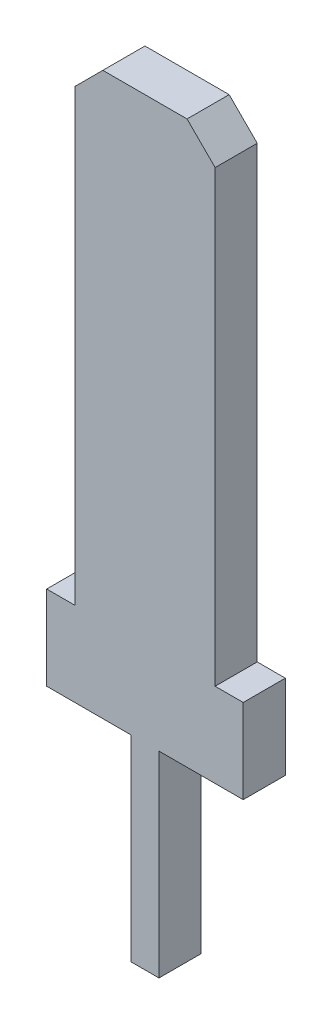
ISO-10303-21;
HEADER;
FILE_DESCRIPTION(('STEP AP214'),'2;1');
FILE_NAME('part.step','',(''),(''),'','','');
FILE_SCHEMA(('AUTOMOTIVE_DESIGN { 1 0 10303 214 1 1 1 1 }'));
ENDSEC;
DATA;
#1=APPLICATION_CONTEXT('core data for automotive mechanical design processes');
#2=APPLICATION_PROTOCOL_DEFINITION('international standard','automotive_design',2000,#1);
#3=PRODUCT_CONTEXT('',#1,'mechanical');
#4=PRODUCT('Part','Part','',(#3));
#5=PRODUCT_RELATED_PRODUCT_CATEGORY('part','',(#4));
#6=PRODUCT_DEFINITION_FORMATION('','',#4);
#7=PRODUCT_DEFINITION_CONTEXT('part definition',#1,'design');
#8=PRODUCT_DEFINITION('design','',#6,#7);
#9=PRODUCT_DEFINITION_SHAPE('','',#8);
#10=(LENGTH_UNIT() NAMED_UNIT(*) SI_UNIT(.MILLI.,.METRE.));
#11=(NAMED_UNIT(*) PLANE_ANGLE_UNIT() SI_UNIT($,.RADIAN.));
#12=(NAMED_UNIT(*) SI_UNIT($,.STERADIAN.) SOLID_ANGLE_UNIT());
#13=UNCERTAINTY_MEASURE_WITH_UNIT(LENGTH_MEASURE(1.E-05),#10,'distance_accuracy_value','');
#14=(GEOMETRIC_REPRESENTATION_CONTEXT(3) GLOBAL_UNCERTAINTY_ASSIGNED_CONTEXT((#13)) GLOBAL_UNIT_ASSIGNED_CONTEXT((#10,
#11,#12)) REPRESENTATION_CONTEXT('',''));
#15=CARTESIAN_POINT('',(0.,0.,0.));
#16=DIRECTION('',(0.,0.,1.));
#17=DIRECTION('',(1.,0.,0.));
#18=AXIS2_PLACEMENT_3D('',#15,#16,#17);
#19=CARTESIAN_POINT('',(1.74999999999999,1.5,0.375));
#20=DIRECTION('',(0.,-1.,0.));
#21=DIRECTION('',(1.,0.,0.));
#22=AXIS2_PLACEMENT_3D('',#19,#20,#21);
#23=PLANE('',#22);
#24=DIRECTION('',(-1.,0.,0.));
#25=VECTOR('',#24,1.);
#26=CARTESIAN_POINT('',(1.74999999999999,1.5,-0.375));
#27=LINE('',#26,#25);
#28=CARTESIAN_POINT('',(1.74999999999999,1.5,-0.375));
#29=VERTEX_POINT('',#28);
#30=CARTESIAN_POINT('',(1.25,1.5,-0.375));
#31=VERTEX_POINT('',#30);
#32=EDGE_CURVE('E137',#29,#31,#27,.T.);
#33=ORIENTED_EDGE('',*,*,#32,.T.);
#34=DIRECTION('',(0.,0.,-1.));
#35=VECTOR('',#34,1.);
#36=CARTESIAN_POINT('',(1.25,1.5,0.375));
#37=LINE('',#36,#35);
#38=CARTESIAN_POINT('',(1.25,1.5,0.375));
#39=VERTEX_POINT('',#38);
#40=EDGE_CURVE('E144',#39,#31,#37,.T.);
#41=ORIENTED_EDGE('',*,*,#40,.F.);
#42=DIRECTION('',(-1.,0.,0.));
#43=VECTOR('',#42,1.);
#44=CARTESIAN_POINT('',(1.74999999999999,1.5,0.375));
#45=LINE('',#44,#43);
#46=CARTESIAN_POINT('',(1.74999999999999,1.5,0.375));
#47=VERTEX_POINT('',#46);
#48=EDGE_CURVE('E178',#47,#39,#45,.T.);
#49=ORIENTED_EDGE('',*,*,#48,.F.);
#50=DIRECTION('',(0.,0.,-1.));
#51=VECTOR('',#50,1.);
#52=CARTESIAN_POINT('',(1.74999999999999,1.5,0.375));
#53=LINE('',#52,#51);
#54=EDGE_CURVE('E156',#47,#29,#53,.T.);
#55=ORIENTED_EDGE('',*,*,#54,.T.);
#56=EDGE_LOOP('',(#33,#41,#49,#55));
#57=FACE_BOUND('',#56,.T.);
#58=ADVANCED_FACE('F33',(#57),#23,.F.);
#59=CARTESIAN_POINT('',(1.25,10.,0.375));
#60=DIRECTION('',(-1.,0.,0.));
#61=DIRECTION('',(0.,-1.,0.));
#62=AXIS2_PLACEMENT_3D('',#59,#60,#61);
#63=PLANE('',#62);
#64=DIRECTION('',(0.,1.,0.));
#65=VECTOR('',#64,1.);
#66=CARTESIAN_POINT('',(1.25,10.,-0.375));
#67=LINE('',#66,#65);
#68=CARTESIAN_POINT('',(1.25,9.5,-0.375));
#69=VERTEX_POINT('',#68);
#70=EDGE_CURVE('E132',#31,#69,#67,.T.);
#71=ORIENTED_EDGE('',*,*,#70,.T.);
#72=DIRECTION('',(0.,0.,1.));
#73=VECTOR('',#72,1.);
#74=CARTESIAN_POINT('',(1.25,9.5,0.375));
#75=LINE('',#74,#73);
#76=CARTESIAN_POINT('',(1.25,9.5,0.375));
#77=VERTEX_POINT('',#76);
#78=EDGE_CURVE('E228',#69,#77,#75,.T.);
#79=ORIENTED_EDGE('',*,*,#78,.T.);
#80=DIRECTION('',(0.,1.,0.));
#81=VECTOR('',#80,1.);
#82=CARTESIAN_POINT('',(1.25,10.,0.375));
#83=LINE('',#82,#81);
#84=EDGE_CURVE('E147',#39,#77,#83,.T.);
#85=ORIENTED_EDGE('',*,*,#84,.F.);
#86=ORIENTED_EDGE('',*,*,#40,.T.);
#87=EDGE_LOOP('',(#71,#79,#85,#86));
#88=FACE_BOUND('',#87,.T.);
#89=ADVANCED_FACE('F145',(#88),#63,.F.);
#90=CARTESIAN_POINT('',(1.25,10.,0.375));
#91=DIRECTION('',(0.,-1.,0.));
#92=DIRECTION('',(0.,0.,-1.));
#93=AXIS2_PLACEMENT_3D('',#90,#91,#92);
#94=PLANE('',#93);
#95=DIRECTION('',(-1.,0.,0.));
#96=VECTOR('',#95,1.);
#97=CARTESIAN_POINT('',(1.25,10.,-0.375));
#98=LINE('',#97,#96);
#99=CARTESIAN_POINT('',(0.749999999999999,10.,-0.375));
#100=VERTEX_POINT('',#99);
#101=CARTESIAN_POINT('',(-0.749999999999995,10.,-0.375));
#102=VERTEX_POINT('',#101);
#103=EDGE_CURVE('E141',#100,#102,#98,.T.);
#104=ORIENTED_EDGE('',*,*,#103,.T.);
#105=DIRECTION('',(0.,0.,1.));
#106=VECTOR('',#105,1.);
#107=CARTESIAN_POINT('',(-0.749999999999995,10.,0.375));
#108=LINE('',#107,#106);
#109=CARTESIAN_POINT('',(-0.749999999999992,10.,0.375));
#110=VERTEX_POINT('',#109);
#111=EDGE_CURVE('E40',#102,#110,#108,.T.);
#112=ORIENTED_EDGE('',*,*,#111,.T.);
#113=DIRECTION('',(-1.,0.,0.));
#114=VECTOR('',#113,1.);
#115=CARTESIAN_POINT('',(1.25,10.,0.375));
#116=LINE('',#115,#114);
#117=CARTESIAN_POINT('',(0.749999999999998,10.,0.375));
#118=VERTEX_POINT('',#117);
#119=EDGE_CURVE('E181',#118,#110,#116,.T.);
#120=ORIENTED_EDGE('',*,*,#119,.F.);
#121=DIRECTION('',(0.,0.,-1.));
#122=VECTOR('',#121,1.);
#123=CARTESIAN_POINT('',(0.749999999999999,10.,0.375));
#124=LINE('',#123,#122);
#125=EDGE_CURVE('E151',#118,#100,#124,.T.);
#126=ORIENTED_EDGE('',*,*,#125,.T.);
#127=EDGE_LOOP('',(#104,#112,#120,#126));
#128=FACE_BOUND('',#127,.T.);
#129=ADVANCED_FACE('F270',(#128),#94,.F.);
#130=CARTESIAN_POINT('',(-1.25,10.,0.375));
#131=DIRECTION('',(1.,0.,0.));
#132=DIRECTION('',(0.,1.,0.));
#133=AXIS2_PLACEMENT_3D('',#130,#131,#132);
#134=PLANE('',#133);
#135=DIRECTION('',(0.,-1.,0.));
#136=VECTOR('',#135,1.);
#137=CARTESIAN_POINT('',(-1.25,10.,0.375));
#138=LINE('',#137,#136);
#139=CARTESIAN_POINT('',(-1.25,9.5,0.375));
#140=VERTEX_POINT('',#139);
#141=CARTESIAN_POINT('',(-1.25,1.5,0.375));
#142=VERTEX_POINT('',#141);
#143=EDGE_CURVE('E183',#140,#142,#138,.T.);
#144=ORIENTED_EDGE('',*,*,#143,.F.);
#145=DIRECTION('',(0.,0.,-1.));
#146=VECTOR('',#145,1.);
#147=CARTESIAN_POINT('',(-1.25,9.5,0.375));
#148=LINE('',#147,#146);
#149=CARTESIAN_POINT('',(-1.25,9.5,-0.375));
#150=VERTEX_POINT('',#149);
#151=EDGE_CURVE('E232',#140,#150,#148,.T.);
#152=ORIENTED_EDGE('',*,*,#151,.T.);
#153=DIRECTION('',(0.,-1.,0.));
#154=VECTOR('',#153,1.);
#155=CARTESIAN_POINT('',(-1.25,10.,-0.375));
#156=LINE('',#155,#154);
#157=CARTESIAN_POINT('',(-1.25,1.5,-0.375));
#158=VERTEX_POINT('',#157);
#159=EDGE_CURVE('E160',#150,#158,#156,.T.);
#160=ORIENTED_EDGE('',*,*,#159,.T.);
#161=DIRECTION('',(0.,0.,-1.));
#162=VECTOR('',#161,1.);
#163=CARTESIAN_POINT('',(-1.25,1.5,0.375));
#164=LINE('',#163,#162);
#165=EDGE_CURVE('E152',#142,#158,#164,.T.);
#166=ORIENTED_EDGE('',*,*,#165,.F.);
#167=EDGE_LOOP('',(#144,#152,#160,#166));
#168=FACE_BOUND('',#167,.T.);
#169=ADVANCED_FACE('F238',(#168),#134,.F.);
#170=CARTESIAN_POINT('',(-1.74999999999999,1.5,0.375));
#171=DIRECTION('',(0.,-1.,0.));
#172=DIRECTION('',(1.,0.,0.));
#173=AXIS2_PLACEMENT_3D('',#170,#171,#172);
#174=PLANE('',#173);
#175=DIRECTION('',(-1.,0.,0.));
#176=VECTOR('',#175,1.);
#177=CARTESIAN_POINT('',(-1.74999999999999,1.5,-0.375));
#178=LINE('',#177,#176);
#179=CARTESIAN_POINT('',(-1.74999999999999,1.5,-0.375));
#180=VERTEX_POINT('',#179);
#181=EDGE_CURVE('E162',#158,#180,#178,.T.);
#182=ORIENTED_EDGE('',*,*,#181,.T.);
#183=DIRECTION('',(0.,0.,-1.));
#184=VECTOR('',#183,1.);
#185=CARTESIAN_POINT('',(-1.74999999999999,1.5,0.375));
#186=LINE('',#185,#184);
#187=CARTESIAN_POINT('',(-1.74999999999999,1.5,0.375));
#188=VERTEX_POINT('',#187);
#189=EDGE_CURVE('E220',#188,#180,#186,.T.);
#190=ORIENTED_EDGE('',*,*,#189,.F.);
#191=DIRECTION('',(-1.,0.,0.));
#192=VECTOR('',#191,1.);
#193=CARTESIAN_POINT('',(-1.74999999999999,1.5,0.375));
#194=LINE('',#193,#192);
#195=EDGE_CURVE('E185',#142,#188,#194,.T.);
#196=ORIENTED_EDGE('',*,*,#195,.F.);
#197=ORIENTED_EDGE('',*,*,#165,.T.);
#198=EDGE_LOOP('',(#182,#190,#196,#197));
#199=FACE_BOUND('',#198,.T.);
#200=ADVANCED_FACE('F247',(#199),#174,.F.);
#201=CARTESIAN_POINT('',(-1.74999999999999,1.5,0.375));
#202=DIRECTION('',(1.,0.,0.));
#203=DIRECTION('',(0.,0.,-1.));
#204=AXIS2_PLACEMENT_3D('',#201,#202,#203);
#205=PLANE('',#204);
#206=DIRECTION('',(0.,-1.,0.));
#207=VECTOR('',#206,1.);
#208=CARTESIAN_POINT('',(-1.74999999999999,1.5,-0.375));
#209=LINE('',#208,#207);
#210=CARTESIAN_POINT('',(-1.74999999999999,0.,-0.375));
#211=VERTEX_POINT('',#210);
#212=EDGE_CURVE('E164',#180,#211,#209,.T.);
#213=ORIENTED_EDGE('',*,*,#212,.T.);
#214=DIRECTION('',(0.,0.,-1.));
#215=VECTOR('',#214,1.);
#216=CARTESIAN_POINT('',(-1.74999999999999,0.,0.375));
#217=LINE('',#216,#215);
#218=CARTESIAN_POINT('',(-1.74999999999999,0.,0.375));
#219=VERTEX_POINT('',#218);
#220=EDGE_CURVE('E217',#219,#211,#217,.T.);
#221=ORIENTED_EDGE('',*,*,#220,.F.);
#222=DIRECTION('',(0.,-1.,0.));
#223=VECTOR('',#222,1.);
#224=CARTESIAN_POINT('',(-1.74999999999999,1.5,0.375));
#225=LINE('',#224,#223);
#226=EDGE_CURVE('E187',#188,#219,#225,.T.);
#227=ORIENTED_EDGE('',*,*,#226,.F.);
#228=ORIENTED_EDGE('',*,*,#189,.T.);
#229=EDGE_LOOP('',(#213,#221,#227,#228));
#230=FACE_BOUND('',#229,.T.);
#231=ADVANCED_FACE('F251',(#230),#205,.F.);
#232=CARTESIAN_POINT('',(-1.74999999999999,0.,0.375));
#233=DIRECTION('',(0.,1.,0.));
#234=DIRECTION('',(0.,0.,1.));
#235=AXIS2_PLACEMENT_3D('',#232,#233,#234);
#236=PLANE('',#235);
#237=DIRECTION('',(1.,0.,0.));
#238=VECTOR('',#237,1.);
#239=CARTESIAN_POINT('',(-1.74999999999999,0.,-0.375));
#240=LINE('',#239,#238);
#241=CARTESIAN_POINT('',(-0.249999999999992,0.,-0.375));
#242=VERTEX_POINT('',#241);
#243=EDGE_CURVE('E166',#211,#242,#240,.T.);
#244=ORIENTED_EDGE('',*,*,#243,.T.);
#245=DIRECTION('',(0.,0.,-1.));
#246=VECTOR('',#245,1.);
#247=CARTESIAN_POINT('',(-0.249999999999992,0.,0.375));
#248=LINE('',#247,#246);
#249=CARTESIAN_POINT('',(-0.249999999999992,0.,0.375));
#250=VERTEX_POINT('',#249);
#251=EDGE_CURVE('E214',#250,#242,#248,.T.);
#252=ORIENTED_EDGE('',*,*,#251,.F.);
#253=DIRECTION('',(1.,0.,0.));
#254=VECTOR('',#253,1.);
#255=CARTESIAN_POINT('',(-1.74999999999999,0.,0.375));
#256=LINE('',#255,#254);
#257=EDGE_CURVE('E189',#219,#250,#256,.T.);
#258=ORIENTED_EDGE('',*,*,#257,.F.);
#259=ORIENTED_EDGE('',*,*,#220,.T.);
#260=EDGE_LOOP('',(#244,#252,#258,#259));
#261=FACE_BOUND('',#260,.T.);
#262=ADVANCED_FACE('F282',(#261),#236,.F.);
#263=CARTESIAN_POINT('',(-0.249999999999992,0.,0.375));
#264=DIRECTION('',(1.,0.,0.));
#265=DIRECTION('',(0.,1.,0.));
#266=AXIS2_PLACEMENT_3D('',#263,#264,#265);
#267=PLANE('',#266);
#268=DIRECTION('',(0.,-1.,0.));
#269=VECTOR('',#268,1.);
#270=CARTESIAN_POINT('',(-0.249999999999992,0.,-0.375));
#271=LINE('',#270,#269);
#272=CARTESIAN_POINT('',(-0.249999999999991,-3.5,-0.375));
#273=VERTEX_POINT('',#272);
#274=EDGE_CURVE('E168',#242,#273,#271,.T.);
#275=ORIENTED_EDGE('',*,*,#274,.T.);
#276=DIRECTION('',(0.,0.,-1.));
#277=VECTOR('',#276,1.);
#278=CARTESIAN_POINT('',(-0.249999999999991,-3.5,0.375));
#279=LINE('',#278,#277);
#280=CARTESIAN_POINT('',(-0.249999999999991,-3.5,0.375));
#281=VERTEX_POINT('',#280);
#282=EDGE_CURVE('E211',#281,#273,#279,.T.);
#283=ORIENTED_EDGE('',*,*,#282,.F.);
#284=DIRECTION('',(0.,-1.,0.));
#285=VECTOR('',#284,1.);
#286=CARTESIAN_POINT('',(-0.249999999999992,0.,0.375));
#287=LINE('',#286,#285);
#288=EDGE_CURVE('E191',#250,#281,#287,.T.);
#289=ORIENTED_EDGE('',*,*,#288,.F.);
#290=ORIENTED_EDGE('',*,*,#251,.T.);
#291=EDGE_LOOP('',(#275,#283,#289,#290));
#292=FACE_BOUND('',#291,.T.);
#293=ADVANCED_FACE('F285',(#292),#267,.F.);
#294=CARTESIAN_POINT('',(-0.249999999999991,-3.5,0.375));
#295=DIRECTION('',(0.,1.,0.));
#296=DIRECTION('',(0.,0.,1.));
#297=AXIS2_PLACEMENT_3D('',#294,#295,#296);
#298=PLANE('',#297);
#299=DIRECTION('',(1.,0.,0.));
#300=VECTOR('',#299,1.);
#301=CARTESIAN_POINT('',(-0.249999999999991,-3.5,-0.375));
#302=LINE('',#301,#300);
#303=CARTESIAN_POINT('',(0.249999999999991,-3.5,-0.375));
#304=VERTEX_POINT('',#303);
#305=EDGE_CURVE('E170',#273,#304,#302,.T.);
#306=ORIENTED_EDGE('',*,*,#305,.T.);
#307=DIRECTION('',(0.,0.,-1.));
#308=VECTOR('',#307,1.);
#309=CARTESIAN_POINT('',(0.249999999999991,-3.5,0.375));
#310=LINE('',#309,#308);
#311=CARTESIAN_POINT('',(0.249999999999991,-3.5,0.375));
#312=VERTEX_POINT('',#311);
#313=EDGE_CURVE('E208',#312,#304,#310,.T.);
#314=ORIENTED_EDGE('',*,*,#313,.F.);
#315=DIRECTION('',(1.,0.,0.));
#316=VECTOR('',#315,1.);
#317=CARTESIAN_POINT('',(-0.249999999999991,-3.5,0.375));
#318=LINE('',#317,#316);
#319=EDGE_CURVE('E193',#281,#312,#318,.T.);
#320=ORIENTED_EDGE('',*,*,#319,.F.);
#321=ORIENTED_EDGE('',*,*,#282,.T.);
#322=EDGE_LOOP('',(#306,#314,#320,#321));
#323=FACE_BOUND('',#322,.T.);
#324=ADVANCED_FACE('F289',(#323),#298,.F.);
#325=CARTESIAN_POINT('',(0.249999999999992,0.,0.375));
#326=DIRECTION('',(-1.,0.,0.));
#327=DIRECTION('',(0.,-1.,0.));
#328=AXIS2_PLACEMENT_3D('',#325,#326,#327);
#329=PLANE('',#328);
#330=DIRECTION('',(0.,1.,0.));
#331=VECTOR('',#330,1.);
#332=CARTESIAN_POINT('',(0.249999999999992,0.,-0.375));
#333=LINE('',#332,#331);
#334=CARTESIAN_POINT('',(0.249999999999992,0.,-0.375));
#335=VERTEX_POINT('',#334);
#336=EDGE_CURVE('E172',#304,#335,#333,.T.);
#337=ORIENTED_EDGE('',*,*,#336,.T.);
#338=DIRECTION('',(0.,0.,-1.));
#339=VECTOR('',#338,1.);
#340=CARTESIAN_POINT('',(0.249999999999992,0.,0.375));
#341=LINE('',#340,#339);
#342=CARTESIAN_POINT('',(0.249999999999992,0.,0.375));
#343=VERTEX_POINT('',#342);
#344=EDGE_CURVE('E205',#343,#335,#341,.T.);
#345=ORIENTED_EDGE('',*,*,#344,.F.);
#346=DIRECTION('',(0.,1.,0.));
#347=VECTOR('',#346,1.);
#348=CARTESIAN_POINT('',(0.249999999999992,0.,0.375));
#349=LINE('',#348,#347);
#350=EDGE_CURVE('E195',#312,#343,#349,.T.);
#351=ORIENTED_EDGE('',*,*,#350,.F.);
#352=ORIENTED_EDGE('',*,*,#313,.T.);
#353=EDGE_LOOP('',(#337,#345,#351,#352));
#354=FACE_BOUND('',#353,.T.);
#355=ADVANCED_FACE('F293',(#354),#329,.F.);
#356=CARTESIAN_POINT('',(1.74999999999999,0.,0.375));
#357=DIRECTION('',(0.,1.,0.));
#358=DIRECTION('',(0.,0.,1.));
#359=AXIS2_PLACEMENT_3D('',#356,#357,#358);
#360=PLANE('',#359);
#361=DIRECTION('',(1.,0.,0.));
#362=VECTOR('',#361,1.);
#363=CARTESIAN_POINT('',(1.74999999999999,0.,-0.375));
#364=LINE('',#363,#362);
#365=CARTESIAN_POINT('',(1.74999999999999,0.,-0.375));
#366=VERTEX_POINT('',#365);
#367=EDGE_CURVE('E174',#335,#366,#364,.T.);
#368=ORIENTED_EDGE('',*,*,#367,.T.);
#369=DIRECTION('',(0.,0.,-1.));
#370=VECTOR('',#369,1.);
#371=CARTESIAN_POINT('',(1.74999999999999,0.,0.375));
#372=LINE('',#371,#370);
#373=CARTESIAN_POINT('',(1.74999999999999,0.,0.375));
#374=VERTEX_POINT('',#373);
#375=EDGE_CURVE('E202',#374,#366,#372,.T.);
#376=ORIENTED_EDGE('',*,*,#375,.F.);
#377=DIRECTION('',(1.,0.,0.));
#378=VECTOR('',#377,1.);
#379=CARTESIAN_POINT('',(1.74999999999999,0.,0.375));
#380=LINE('',#379,#378);
#381=EDGE_CURVE('E197',#343,#374,#380,.T.);
#382=ORIENTED_EDGE('',*,*,#381,.F.);
#383=ORIENTED_EDGE('',*,*,#344,.T.);
#384=EDGE_LOOP('',(#368,#376,#382,#383));
#385=FACE_BOUND('',#384,.T.);
#386=ADVANCED_FACE('F297',(#385),#360,.F.);
#387=CARTESIAN_POINT('',(1.74999999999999,1.5,0.375));
#388=DIRECTION('',(-1.,0.,0.));
#389=DIRECTION('',(0.,0.,1.));
#390=AXIS2_PLACEMENT_3D('',#387,#388,#389);
#391=PLANE('',#390);
#392=DIRECTION('',(0.,1.,0.));
#393=VECTOR('',#392,1.);
#394=CARTESIAN_POINT('',(1.74999999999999,1.5,-0.375));
#395=LINE('',#394,#393);
#396=EDGE_CURVE('E176',#366,#29,#395,.T.);
#397=ORIENTED_EDGE('',*,*,#396,.T.);
#398=ORIENTED_EDGE('',*,*,#54,.F.);
#399=DIRECTION('',(0.,1.,0.));
#400=VECTOR('',#399,1.);
#401=CARTESIAN_POINT('',(1.74999999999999,1.5,0.375));
#402=LINE('',#401,#400);
#403=EDGE_CURVE('E199',#374,#47,#402,.T.);
#404=ORIENTED_EDGE('',*,*,#403,.F.);
#405=ORIENTED_EDGE('',*,*,#375,.T.);
#406=EDGE_LOOP('',(#397,#398,#404,#405));
#407=FACE_BOUND('',#406,.T.);
#408=ADVANCED_FACE('F301',(#407),#391,.F.);
#409=CARTESIAN_POINT('',(0.249999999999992,1.5,0.375));
#410=DIRECTION('',(0.,0.,1.));
#411=DIRECTION('',(1.,0.,0.));
#412=AXIS2_PLACEMENT_3D('',#409,#410,#411);
#413=PLANE('',#412);
#414=ORIENTED_EDGE('',*,*,#119,.T.);
#415=DIRECTION('',(0.70710678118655,0.707106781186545,0.));
#416=VECTOR('',#415,1.);
#417=CARTESIAN_POINT('',(-4.5,6.25000000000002,0.375));
#418=LINE('',#417,#416);
#419=EDGE_CURVE('E11',#110,#140,#418,.F.);
#420=ORIENTED_EDGE('',*,*,#419,.T.);
#421=ORIENTED_EDGE('',*,*,#143,.T.);
#422=ORIENTED_EDGE('',*,*,#195,.T.);
#423=ORIENTED_EDGE('',*,*,#226,.T.);
#424=ORIENTED_EDGE('',*,*,#257,.T.);
#425=ORIENTED_EDGE('',*,*,#288,.T.);
#426=ORIENTED_EDGE('',*,*,#319,.T.);
#427=ORIENTED_EDGE('',*,*,#350,.T.);
#428=ORIENTED_EDGE('',*,*,#381,.T.);
#429=ORIENTED_EDGE('',*,*,#403,.T.);
#430=ORIENTED_EDGE('',*,*,#48,.T.);
#431=ORIENTED_EDGE('',*,*,#84,.T.);
#432=DIRECTION('',(0.707106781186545,-0.70710678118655,0.));
#433=VECTOR('',#432,1.);
#434=CARTESIAN_POINT('',(4.75,5.99999999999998,0.375));
#435=LINE('',#434,#433);
#436=EDGE_CURVE('E230',#77,#118,#435,.F.);
#437=ORIENTED_EDGE('',*,*,#436,.T.);
#438=EDGE_LOOP('',(#414,#420,#421,#422,#423,#424,#425,#426,#427,#428,#429,#430,#431,#437));
#439=FACE_BOUND('',#438,.T.);
#440=ADVANCED_FACE('F255',(#439),#413,.T.);
#441=CARTESIAN_POINT('',(0.249999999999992,1.5,-0.375));
#442=DIRECTION('',(0.,0.,1.));
#443=DIRECTION('',(1.,0.,0.));
#444=AXIS2_PLACEMENT_3D('',#441,#442,#443);
#445=PLANE('',#444);
#446=ORIENTED_EDGE('',*,*,#159,.F.);
#447=DIRECTION('',(-0.70710678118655,-0.707106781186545,0.));
#448=VECTOR('',#447,1.);
#449=CARTESIAN_POINT('',(-1.25,9.5,-0.375));
#450=LINE('',#449,#448);
#451=EDGE_CURVE('E54',#150,#102,#450,.F.);
#452=ORIENTED_EDGE('',*,*,#451,.T.);
#453=ORIENTED_EDGE('',*,*,#103,.F.);
#454=DIRECTION('',(-0.707106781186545,0.70710678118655,0.));
#455=VECTOR('',#454,1.);
#456=CARTESIAN_POINT('',(0.749999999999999,10.,-0.375));
#457=LINE('',#456,#455);
#458=EDGE_CURVE('E138',#100,#69,#457,.F.);
#459=ORIENTED_EDGE('',*,*,#458,.T.);
#460=ORIENTED_EDGE('',*,*,#70,.F.);
#461=ORIENTED_EDGE('',*,*,#32,.F.);
#462=ORIENTED_EDGE('',*,*,#396,.F.);
#463=ORIENTED_EDGE('',*,*,#367,.F.);
#464=ORIENTED_EDGE('',*,*,#336,.F.);
#465=ORIENTED_EDGE('',*,*,#305,.F.);
#466=ORIENTED_EDGE('',*,*,#274,.F.);
#467=ORIENTED_EDGE('',*,*,#243,.F.);
#468=ORIENTED_EDGE('',*,*,#212,.F.);
#469=ORIENTED_EDGE('',*,*,#181,.F.);
#470=EDGE_LOOP('',(#446,#452,#453,#459,#460,#461,#462,#463,#464,#465,#466,#467,#468,#469));
#471=FACE_BOUND('',#470,.T.);
#472=ADVANCED_FACE('F134',(#471),#445,.F.);
#473=CARTESIAN_POINT('',(0.749999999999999,10.,0.375));
#474=DIRECTION('',(-0.70710678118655,-0.707106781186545,0.));
#475=DIRECTION('',(0.707106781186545,-0.70710678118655,0.));
#476=AXIS2_PLACEMENT_3D('',#473,#474,#475);
#477=PLANE('',#476);
#478=ORIENTED_EDGE('',*,*,#436,.F.);
#479=ORIENTED_EDGE('',*,*,#78,.F.);
#480=ORIENTED_EDGE('',*,*,#458,.F.);
#481=ORIENTED_EDGE('',*,*,#125,.F.);
#482=EDGE_LOOP('',(#478,#479,#480,#481));
#483=FACE_BOUND('',#482,.T.);
#484=ADVANCED_FACE('F259',(#483),#477,.F.);
#485=CARTESIAN_POINT('',(-1.25,9.5,0.375));
#486=DIRECTION('',(0.707106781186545,-0.70710678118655,0.));
#487=DIRECTION('',(0.70710678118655,0.707106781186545,0.));
#488=AXIS2_PLACEMENT_3D('',#485,#486,#487);
#489=PLANE('',#488);
#490=ORIENTED_EDGE('',*,*,#419,.F.);
#491=ORIENTED_EDGE('',*,*,#111,.F.);
#492=ORIENTED_EDGE('',*,*,#451,.F.);
#493=ORIENTED_EDGE('',*,*,#151,.F.);
#494=EDGE_LOOP('',(#490,#491,#492,#493));
#495=FACE_BOUND('',#494,.T.);
#496=ADVANCED_FACE('F257',(#495),#489,.F.);
#497=CLOSED_SHELL('',(#58,#89,#129,#169,#200,#231,#262,#293,#324,#355,#386,#408,#440,#472,#484,#496));
#498=MANIFOLD_SOLID_BREP('B2',#497);
#499=ADVANCED_BREP_SHAPE_REPRESENTATION('',(#18,#498),#14);
#500=SHAPE_DEFINITION_REPRESENTATION(#9,#499);
ENDSEC;
END-ISO-10303-21;
